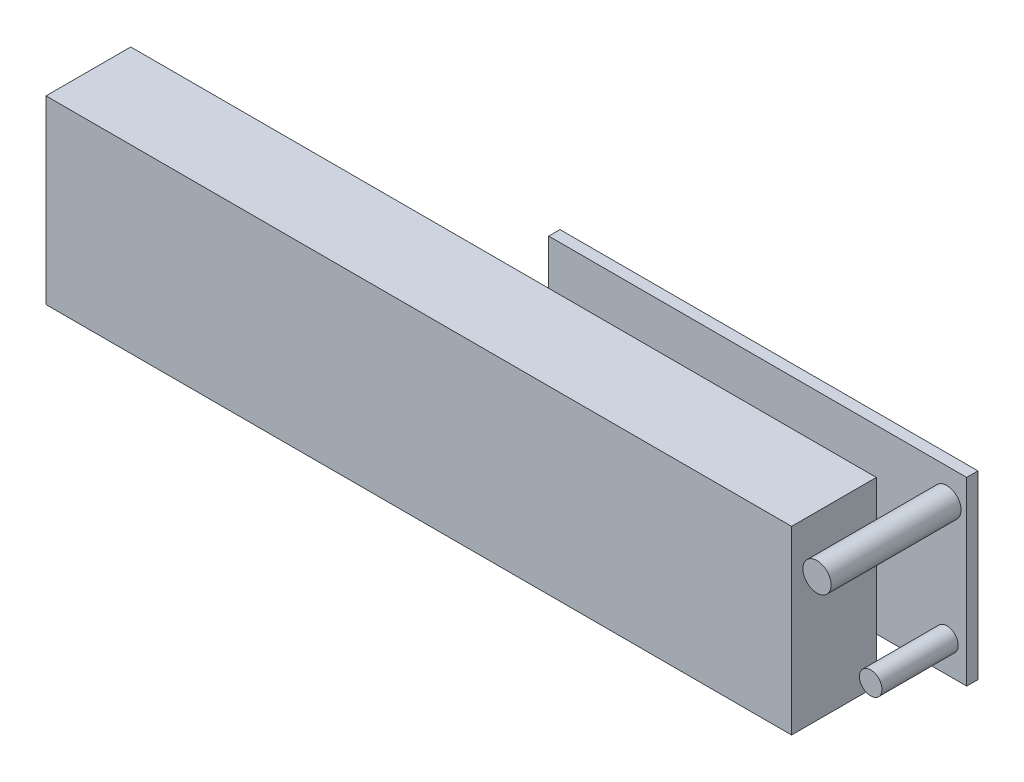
from build123d import *

# Parameters (mm, degrees)
SKETCH_1_W      = 132
SKETCH_1_H      = 32
EXTRUDE_1_DEPTH = 15
EXTRUDE_START   = 8
SKETCH_2_W      = 74
SKETCH_2_H      = 32
EXTRUDE_2_DEPTH = 2
EXTRUDE_3_DEPTH = 23
EXTRUDE_4_DEPTH = 13.5


with BuildPart() as part:
    # Sketch 1 → Extrude 1 (new body)
    with BuildSketch(Plane.XY):
        Rectangle(SKETCH_1_W, SKETCH_1_H)
    extrude(amount=EXTRUDE_1_DEPTH)


with BuildPart() as body_2:
    # Sketch 2 → Extrude 2 (new body)
    with BuildSketch(Plane(origin=(0, 0, 0), x_dir=(-1, 0, 0), z_dir=(0, 0, -1)).offset(EXTRUDE_START)):
        with Locations((-37, 0)):
            Rectangle(SKETCH_2_W, SKETCH_2_H)
    extrude(amount=EXTRUDE_2_DEPTH)

    # Sketch 3 → Extrude 3 (add)
    with BuildSketch(Plane.XY.offset(-8)):
        with BuildLine():
            ThreePointArc((73, 10.5), (72.267766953, 12.267766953), (70.5, 13))
            Line((70.5, 13), (70.5, 8))
            ThreePointArc((70.5, 8), (72.267766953, 8.732233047), (73, 10.5))
        make_face()
        with BuildLine():
            Line((70.5, 8), (70.5, 13))
            ThreePointArc((70.5, 13), (68, 10.5), (70.5, 8))
        make_face()
        with BuildLine():
            ThreePointArc((73, 10.5), (72.267766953, 12.267766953), (70.5, 13))
            Line((70.5, 13), (70.5, 8))
            ThreePointArc((70.5, 8), (72.267766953, 8.732233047), (73, 10.5))
        make_face()
        with BuildLine():
            Line((70.5, 8), (70.5, 13))
            ThreePointArc((70.5, 13), (68, 10.5), (70.5, 8))
        make_face()
    extrude(amount=EXTRUDE_3_DEPTH)

    # Sketch 3_3 → Extrude 4 (add)
    with BuildSketch(Plane.XY.offset(-8)):
        with BuildLine():
            ThreePointArc((72.5, -10.5), (71.914213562, -9.085786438), (70.5, -8.5))
            Line((70.5, -8.5), (70.5, -12.5))
            ThreePointArc((70.5, -12.5), (71.914213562, -11.914213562), (72.5, -10.5))
        make_face()
        with BuildLine():
            Line((70.5, -12.5), (70.5, -8.5))
            ThreePointArc((70.5, -8.5), (68.5, -10.5), (70.5, -12.5))
        make_face()
        with BuildLine():
            ThreePointArc((72.5, -10.5), (71.914213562, -9.085786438), (70.5, -8.5))
            Line((70.5, -8.5), (70.5, -12.5))
            ThreePointArc((70.5, -12.5), (71.914213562, -11.914213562), (72.5, -10.5))
        make_face()
        with BuildLine():
            Line((70.5, -12.5), (70.5, -8.5))
            ThreePointArc((70.5, -8.5), (68.5, -10.5), (70.5, -12.5))
        make_face()
    extrude(amount=EXTRUDE_4_DEPTH)


solid = Compound([part.part, body_2.part])
